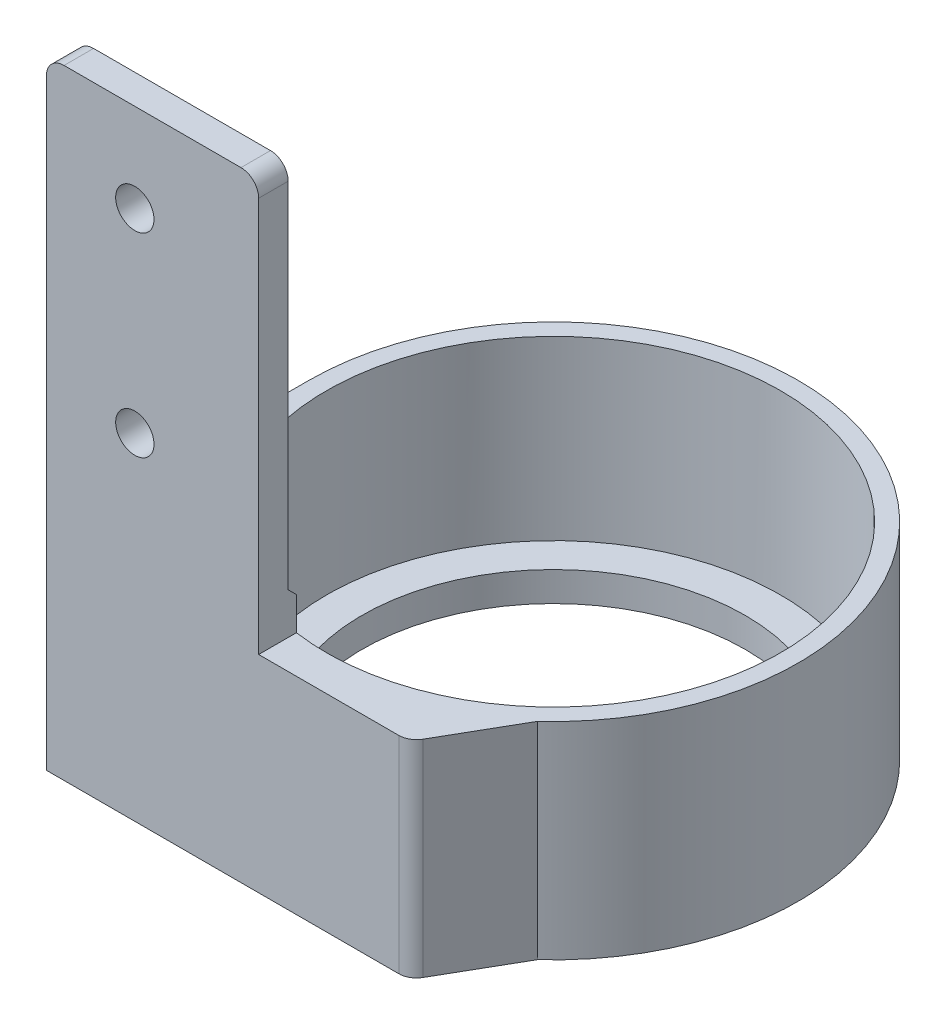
from build123d import *

# Parameters (mm, degrees)
SKIZZE1_R                       = 3.25
AUFSATZ_LINEAR_AUSTRAGEN1_DEPTH = 3
SKIZZE4_R                       = 41.5
AUFSATZ_LINEAR_AUSTRAGEN2_DEPTH = 35
SKIZZE6_R                       = 38.5
SCHNITT_LINEAR_AUSTRAGEN1_DEPTH = 160.091168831
LINEAR_AUSTRAGEN_D_NN1_START    = -30
SKIZZE7_R                       = 38.5
SKIZZE7_R_2                     = 32.5
LINEAR_AUSTRAGEN_D_NN1_DEPTH    = 5
SKIZZE16_W                      = 25.5
SKIZZE16_H                      = 35
AUFSATZ_LINEAR_AUSTRAGEN3_DEPTH = 3
AUFSATZ_LINEAR_AUSTRAGEN4_DEPTH = 35
AUFSATZ_LINEAR_AUSTRAGEN5_DEPTH = 35
SCHNITT_LINEAR_AUSTRAGEN3_DEPTH = 139.509927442
SKIZZE29_R                      = 3.25
AUFSATZ_LINEAR_AUSTRAGEN8_DEPTH = 2
AUFSATZ_LINEAR_AUSTRAGEN6_DEPTH = 36
SKIZZE31_R                      = 38.5
SCHNITT_LINEAR_AUSTRAGEN5_DEPTH = 10


with BuildPart() as part:
    # Skizze1 → Aufsatz-Linear austragen1 (new body)
    with BuildSketch(Plane.XY):
        with BuildLine():
            Line((3, 0), (33, 0))
            ThreePointArc((33, 0), (35.121320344, -0.878679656), (36, -3))
            Line((36, -3), (36, -97))
            Line((36, -97), (36, -105))
            Line((36, -105), (33, -105))
            Line((33, -105), (3, -105))
            Line((3, -105), (0, -105))
            Line((0, -105), (0, -97))
            Line((0, -97), (0, -3))
            ThreePointArc((0, -3), (0.878679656, -0.878679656), (3, 0))
        make_face()
        with Locations((15, -15)):
            Circle(SKIZZE1_R, mode=Mode.SUBTRACT)
        with Locations((15, -48)):
            Circle(SKIZZE1_R, mode=Mode.SUBTRACT)
    extrude(amount=AUFSATZ_LINEAR_AUSTRAGEN1_DEPTH)

    # Skizze16 → Aufsatz-Linear austragen3 (add)
    with BuildSketch(Plane(origin=(0, 0, 0), x_dir=(-1, 0, 0), z_dir=(0, 0, -1))):
        with Locations((-48.75, -87.5)):
            Rectangle(SKIZZE16_W, SKIZZE16_H)
    extrude(amount=-AUFSATZ_LINEAR_AUSTRAGEN3_DEPTH)



with BuildPart() as body_2:
    # Skizze4 → Aufsatz-Linear austragen2 (new body)
    with BuildSketch(Plane.XZ.offset(105)):
        with Locations(Location((41.5, 44.5, 0), (0, 0, 270))):
            Circle(SKIZZE4_R)
    extrude(amount=-AUFSATZ_LINEAR_AUSTRAGEN2_DEPTH)

    # Skizze6 → Schnitt-Linear austragen1 (cut, through all)
    with BuildSketch(Plane(origin=(0, -105, 0), x_dir=(-1, 0, 0), z_dir=(0, -1, 0))):
        with Locations(Location((-41.5, -44.5, 0), (0, 0, 90))):
            Circle(SKIZZE6_R)
    extrude(amount=-SCHNITT_LINEAR_AUSTRAGEN1_DEPTH, mode=Mode.SUBTRACT)

    # Skizze7 → Linear-Austragen-D_nn1 (add)
    with BuildSketch(Plane(origin=(0, -70, 0), x_dir=(1, 0, 0), z_dir=(0, 1, 0)).offset(LINEAR_AUSTRAGEN_D_NN1_START)):
        with Locations((41.5, -44.5)):
            Circle(SKIZZE7_R)
        with Locations((41.5, -44.5)):
            Circle(SKIZZE7_R_2, mode=Mode.SUBTRACT)
    extrude(amount=-LINEAR_AUSTRAGEN_D_NN1_DEPTH)


with BuildPart() as part_1:
    add(part.part)

    add(body_2.part)  # Aufsatz-Linear austragen4 merges body 2
    # Skizze17 → Aufsatz-Linear austragen4 (add)
    with BuildSketch(Plane.XZ.offset(105)):
        Polygon((69.453110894, 13.826337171), (65.463261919, 10.61767307), (61.157704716, 7.951065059), (56.456387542, 5.788806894), (51.630976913, 4.255580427), (46.581071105, 3.312226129), (41.5, 3), (61.5, 3), (61.5, 0), align=None)
    extrude(amount=-AUFSATZ_LINEAR_AUSTRAGEN4_DEPTH)

    # Skizze19 → Aufsatz-Linear austragen5 (add)
    with BuildSketch(Plane.XZ.offset(105)):
        Polygon((0, 44.5), (0.292769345, 39.579213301), (1.32012733, 34.115981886), (2.987465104, 29.039254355), (5.405172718, 24.020413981), (8.439906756, 19.41454137), (12.000641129, 15.310313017), (16.158896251, 11.635452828), (20.622161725, 8.634056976), (25.534528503, 6.193946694), (30.699904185, 4.429962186), (36.038410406, 3.360954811), (41.5, 3), (0, 3), align=None)
    extrude(amount=-AUFSATZ_LINEAR_AUSTRAGEN5_DEPTH)

    # Skizze21 → Schnitt-Linear austragen3 (cut, through all)
    with BuildSketch(Plane(origin=(0, -70, 0), x_dir=(1, 0, 0), z_dir=(0, 1, 0))):
        with BuildLine():
            Line((61.5, 0), (59.764741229, 0))
            ThreePointArc((59.764741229, 0), (61.266823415, -0.403127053), (62.365218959, -1.504167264))
            Line((62.365218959, -1.504167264), (61.5, 0))
        make_face()
    extrude(amount=-SCHNITT_LINEAR_AUSTRAGEN3_DEPTH, mode=Mode.SUBTRACT)

    # Skizze29 → Aufsatz-Linear austragen8 (add)
    with BuildSketch(Plane.XY.offset(3)):
        with BuildLine():
            Line((3, 0), (33, 0))
            ThreePointArc((33, 0), (35.121320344, -0.878679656), (36, -3))
            Line((36, -3), (36, -70))
            Line((36, -70), (0, -70))
            Line((0, -70), (0, -3))
            ThreePointArc((0, -3), (0.878679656, -0.878679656), (3, 0))
        make_face()
        with Locations((15, -15)):
            Circle(SKIZZE29_R, mode=Mode.SUBTRACT)
        with Locations((15, -48)):
            Circle(SKIZZE29_R, mode=Mode.SUBTRACT)
    extrude(amount=AUFSATZ_LINEAR_AUSTRAGEN8_DEPTH)

    # Skizze26 → Aufsatz-Linear austragen6 (add)
    with BuildSketch(Plane.ZY):
        Polygon((5, -70), (5, -63), (12, -70), align=None)
    extrude(amount=-AUFSATZ_LINEAR_AUSTRAGEN6_DEPTH)

    # Skizze31 → Schnitt-Linear austragen5 (cut)
    with BuildSketch(Plane(origin=(0, -70, 0), x_dir=(1, 0, 0), z_dir=(0, 1, 0))):
        with Locations(Location((41.5, -44.5, 0), (0, 0, 98.213210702))):
            Circle(SKIZZE31_R)
    extrude(amount=SCHNITT_LINEAR_AUSTRAGEN5_DEPTH, mode=Mode.SUBTRACT)


with BuildPart() as body_2_2:
    # Spiegeln1: mirrored copy
    add(part_1.part.mirror(Plane(origin=(3, -3, 5), x_dir=(1, 0, 0), z_dir=(0, 0, 1))))


solid = body_2_2.part
